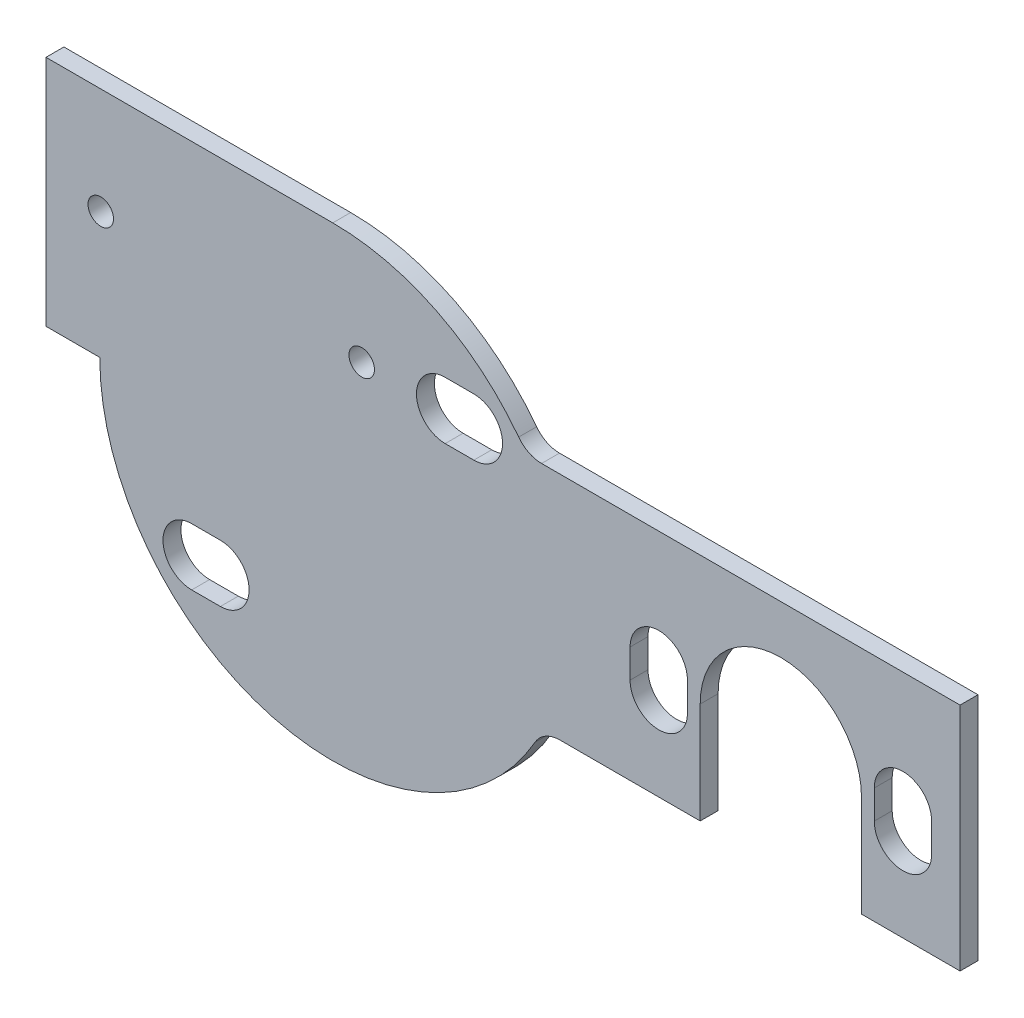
ISO-10303-21;
HEADER;
FILE_DESCRIPTION(('STEP AP214'),'2;1');
FILE_NAME('part.step','',(''),(''),'','','');
FILE_SCHEMA(('AUTOMOTIVE_DESIGN { 1 0 10303 214 1 1 1 1 }'));
ENDSEC;
DATA;
#1=APPLICATION_CONTEXT('core data for automotive mechanical design processes');
#2=APPLICATION_PROTOCOL_DEFINITION('international standard','automotive_design',2000,#1);
#3=PRODUCT_CONTEXT('',#1,'mechanical');
#4=PRODUCT('Part','Part','',(#3));
#5=PRODUCT_RELATED_PRODUCT_CATEGORY('part','',(#4));
#6=PRODUCT_DEFINITION_FORMATION('','',#4);
#7=PRODUCT_DEFINITION_CONTEXT('part definition',#1,'design');
#8=PRODUCT_DEFINITION('design','',#6,#7);
#9=PRODUCT_DEFINITION_SHAPE('','',#8);
#10=(LENGTH_UNIT() NAMED_UNIT(*) SI_UNIT(.MILLI.,.METRE.));
#11=(NAMED_UNIT(*) PLANE_ANGLE_UNIT() SI_UNIT($,.RADIAN.));
#12=(NAMED_UNIT(*) SI_UNIT($,.STERADIAN.) SOLID_ANGLE_UNIT());
#13=UNCERTAINTY_MEASURE_WITH_UNIT(LENGTH_MEASURE(1.E-05),#10,'distance_accuracy_value','');
#14=(GEOMETRIC_REPRESENTATION_CONTEXT(3) GLOBAL_UNCERTAINTY_ASSIGNED_CONTEXT((#13)) GLOBAL_UNIT_ASSIGNED_CONTEXT((#10,
#11,#12)) REPRESENTATION_CONTEXT('',''));
#15=CARTESIAN_POINT('',(0.,0.,0.));
#16=DIRECTION('',(0.,0.,1.));
#17=DIRECTION('',(1.,0.,0.));
#18=AXIS2_PLACEMENT_3D('',#15,#16,#17);
#19=CARTESIAN_POINT('',(0.,8.97150910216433,1.58750000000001));
#20=DIRECTION('',(0.,0.,-1.));
#21=DIRECTION('',(-1.,0.,0.));
#22=AXIS2_PLACEMENT_3D('',#19,#20,#21);
#23=CYLINDRICAL_SURFACE('',#22,20.6375);
#24=CARTESIAN_POINT('',(0.,8.97150910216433,0.));
#25=DIRECTION('',(0.,0.,-1.));
#26=DIRECTION('',(-1.,0.,0.));
#27=AXIS2_PLACEMENT_3D('',#24,#25,#26);
#28=CIRCLE('',#27,20.6375);
#29=CARTESIAN_POINT('',(17.9121311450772,-1.27846475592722,0.));
#30=VERTEX_POINT('',#29);
#31=CARTESIAN_POINT('',(-20.6375,8.9715091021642,0.));
#32=VERTEX_POINT('',#31);
#33=EDGE_CURVE('E354',#30,#32,#28,.T.);
#34=ORIENTED_EDGE('',*,*,#33,.F.);
#35=DIRECTION('',(0.,0.,-1.));
#36=VECTOR('',#35,1.);
#37=CARTESIAN_POINT('',(17.9121311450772,-1.27846475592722,1.58750000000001));
#38=LINE('',#37,#36);
#39=CARTESIAN_POINT('',(17.9121311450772,-1.27846475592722,1.58750000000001));
#40=VERTEX_POINT('',#39);
#41=EDGE_CURVE('E11',#40,#30,#38,.T.);
#42=ORIENTED_EDGE('',*,*,#41,.F.);
#43=CARTESIAN_POINT('',(0.,8.97150910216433,1.58750000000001));
#44=DIRECTION('',(0.,0.,-1.));
#45=DIRECTION('',(-1.,0.,0.));
#46=AXIS2_PLACEMENT_3D('',#43,#44,#45);
#47=CIRCLE('',#46,20.6375);
#48=CARTESIAN_POINT('',(-20.6375,8.9715091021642,1.58750000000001));
#49=VERTEX_POINT('',#48);
#50=EDGE_CURVE('E361',#40,#49,#47,.T.);
#51=ORIENTED_EDGE('',*,*,#50,.T.);
#52=DIRECTION('',(0.,0.,-1.));
#53=VECTOR('',#52,1.);
#54=CARTESIAN_POINT('',(-20.6375,8.9715091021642,1.58750000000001));
#55=LINE('',#54,#53);
#56=EDGE_CURVE('E400',#49,#32,#55,.T.);
#57=ORIENTED_EDGE('',*,*,#56,.T.);
#58=EDGE_LOOP('',(#34,#42,#51,#57));
#59=FACE_BOUND('',#58,.T.);
#60=ADVANCED_FACE('F30',(#59),#23,.T.);
#61=CARTESIAN_POINT('',(20.1167011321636,-2.54,1.58750000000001));
#62=DIRECTION('',(0.,0.,-1.));
#63=DIRECTION('',(-1.,0.,0.));
#64=AXIS2_PLACEMENT_3D('',#61,#62,#63);
#65=CYLINDRICAL_SURFACE('',#64,2.54);
#66=CARTESIAN_POINT('',(20.1167011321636,-2.54,0.));
#67=DIRECTION('',(0.,0.,-1.));
#68=DIRECTION('',(-1.,0.,0.));
#69=AXIS2_PLACEMENT_3D('',#66,#67,#68);
#70=CIRCLE('',#69,2.54);
#71=CARTESIAN_POINT('',(20.1167011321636,0.,0.));
#72=VERTEX_POINT('',#71);
#73=EDGE_CURVE('E403',#30,#72,#70,.T.);
#74=ORIENTED_EDGE('',*,*,#73,.T.);
#75=DIRECTION('',(0.,0.,-1.));
#76=VECTOR('',#75,1.);
#77=CARTESIAN_POINT('',(20.1167011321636,0.,1.58750000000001));
#78=LINE('',#77,#76);
#79=CARTESIAN_POINT('',(20.1167011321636,0.,1.58750000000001));
#80=VERTEX_POINT('',#79);
#81=EDGE_CURVE('E37',#80,#72,#78,.T.);
#82=ORIENTED_EDGE('',*,*,#81,.F.);
#83=CARTESIAN_POINT('',(20.1167011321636,-2.54,1.58750000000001));
#84=DIRECTION('',(0.,0.,-1.));
#85=DIRECTION('',(-1.,0.,0.));
#86=AXIS2_PLACEMENT_3D('',#83,#84,#85);
#87=CIRCLE('',#86,2.54);
#88=EDGE_CURVE('E364',#40,#80,#87,.T.);
#89=ORIENTED_EDGE('',*,*,#88,.F.);
#90=ORIENTED_EDGE('',*,*,#41,.T.);
#91=EDGE_LOOP('',(#74,#82,#89,#90));
#92=FACE_BOUND('',#91,.T.);
#93=ADVANCED_FACE('F471',(#92),#65,.F.);
#94=CARTESIAN_POINT('',(-54.1659773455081,1.52655665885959E-13,1.58750000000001));
#95=DIRECTION('',(0.,-1.,0.));
#96=DIRECTION('',(0.,0.,-1.));
#97=AXIS2_PLACEMENT_3D('',#94,#95,#96);
#98=PLANE('',#97);
#99=DIRECTION('',(-1.,0.,0.));
#100=VECTOR('',#99,1.);
#101=CARTESIAN_POINT('',(-54.1659773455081,1.52655665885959E-13,0.));
#102=LINE('',#101,#100);
#103=CARTESIAN_POINT('',(32.5437500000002,0.,0.));
#104=VERTEX_POINT('',#103);
#105=EDGE_CURVE('E406',#104,#72,#102,.T.);
#106=ORIENTED_EDGE('',*,*,#105,.F.);
#107=DIRECTION('',(0.,0.,-1.));
#108=VECTOR('',#107,1.);
#109=CARTESIAN_POINT('',(32.5437500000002,0.,1.58750000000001));
#110=LINE('',#109,#108);
#111=CARTESIAN_POINT('',(32.5437500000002,0.,1.58750000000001));
#112=VERTEX_POINT('',#111);
#113=EDGE_CURVE('E462',#112,#104,#110,.T.);
#114=ORIENTED_EDGE('',*,*,#113,.F.);
#115=DIRECTION('',(-1.,0.,0.));
#116=VECTOR('',#115,1.);
#117=CARTESIAN_POINT('',(-54.1659773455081,1.52655665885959E-13,1.58750000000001));
#118=LINE('',#117,#116);
#119=EDGE_CURVE('E367',#112,#80,#118,.T.);
#120=ORIENTED_EDGE('',*,*,#119,.T.);
#121=ORIENTED_EDGE('',*,*,#81,.T.);
#122=EDGE_LOOP('',(#106,#114,#120,#121));
#123=FACE_BOUND('',#122,.T.);
#124=ADVANCED_FACE('F466',(#123),#98,.T.);
#125=CARTESIAN_POINT('',(32.5437500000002,14.1706045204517,1.58750000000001));
#126=DIRECTION('',(-1.,0.,0.));
#127=DIRECTION('',(0.,0.,1.));
#128=AXIS2_PLACEMENT_3D('',#125,#126,#127);
#129=PLANE('',#128);
#130=DIRECTION('',(0.,1.,0.));
#131=VECTOR('',#130,1.);
#132=CARTESIAN_POINT('',(32.5437500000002,14.1706045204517,0.));
#133=LINE('',#132,#131);
#134=CARTESIAN_POINT('',(32.5437500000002,8.97150910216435,0.));
#135=VERTEX_POINT('',#134);
#136=EDGE_CURVE('E409',#104,#135,#133,.T.);
#137=ORIENTED_EDGE('',*,*,#136,.T.);
#138=DIRECTION('',(0.,0.,-1.));
#139=VECTOR('',#138,1.);
#140=CARTESIAN_POINT('',(32.5437500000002,8.97150910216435,1.58750000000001));
#141=LINE('',#140,#139);
#142=CARTESIAN_POINT('',(32.5437500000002,8.97150910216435,1.58750000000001));
#143=VERTEX_POINT('',#142);
#144=EDGE_CURVE('E459',#143,#135,#141,.T.);
#145=ORIENTED_EDGE('',*,*,#144,.F.);
#146=DIRECTION('',(0.,1.,0.));
#147=VECTOR('',#146,1.);
#148=CARTESIAN_POINT('',(32.5437500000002,14.1706045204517,1.58750000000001));
#149=LINE('',#148,#147);
#150=EDGE_CURVE('E370',#112,#143,#149,.T.);
#151=ORIENTED_EDGE('',*,*,#150,.F.);
#152=ORIENTED_EDGE('',*,*,#113,.T.);
#153=EDGE_LOOP('',(#137,#145,#151,#152));
#154=FACE_BOUND('',#153,.T.);
#155=ADVANCED_FACE('F478',(#154),#129,.F.);
#156=CARTESIAN_POINT('',(39.6875000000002,8.97150910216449,1.58750000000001));
#157=DIRECTION('',(0.,0.,-1.));
#158=DIRECTION('',(-1.,0.,0.));
#159=AXIS2_PLACEMENT_3D('',#156,#157,#158);
#160=CYLINDRICAL_SURFACE('',#159,7.14375);
#161=CARTESIAN_POINT('',(39.6875000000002,8.97150910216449,0.));
#162=DIRECTION('',(0.,0.,-1.));
#163=DIRECTION('',(-1.,0.,0.));
#164=AXIS2_PLACEMENT_3D('',#161,#162,#163);
#165=CIRCLE('',#164,7.14375);
#166=CARTESIAN_POINT('',(46.8312500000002,8.97150910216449,0.));
#167=VERTEX_POINT('',#166);
#168=EDGE_CURVE('E411',#135,#167,#165,.T.);
#169=ORIENTED_EDGE('',*,*,#168,.T.);
#170=DIRECTION('',(0.,0.,-1.));
#171=VECTOR('',#170,1.);
#172=CARTESIAN_POINT('',(46.8312500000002,8.97150910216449,1.58750000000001));
#173=LINE('',#172,#171);
#174=CARTESIAN_POINT('',(46.8312500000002,8.97150910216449,1.58750000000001));
#175=VERTEX_POINT('',#174);
#176=EDGE_CURVE('E457',#175,#167,#173,.T.);
#177=ORIENTED_EDGE('',*,*,#176,.F.);
#178=CARTESIAN_POINT('',(39.6875000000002,8.97150910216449,1.58750000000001));
#179=DIRECTION('',(0.,0.,-1.));
#180=DIRECTION('',(-1.,0.,0.));
#181=AXIS2_PLACEMENT_3D('',#178,#179,#180);
#182=CIRCLE('',#181,7.14375);
#183=EDGE_CURVE('E372',#143,#175,#182,.T.);
#184=ORIENTED_EDGE('',*,*,#183,.F.);
#185=ORIENTED_EDGE('',*,*,#144,.T.);
#186=EDGE_LOOP('',(#169,#177,#184,#185));
#187=FACE_BOUND('',#186,.T.);
#188=ADVANCED_FACE('F482',(#187),#160,.F.);
#189=CARTESIAN_POINT('',(46.8312500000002,14.1706045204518,1.58750000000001));
#190=DIRECTION('',(-1.,0.,0.));
#191=DIRECTION('',(0.,-1.,0.));
#192=AXIS2_PLACEMENT_3D('',#189,#190,#191);
#193=PLANE('',#192);
#194=DIRECTION('',(0.,1.,0.));
#195=VECTOR('',#194,1.);
#196=CARTESIAN_POINT('',(46.8312500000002,14.1706045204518,0.));
#197=LINE('',#196,#195);
#198=CARTESIAN_POINT('',(46.8312500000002,0.,0.));
#199=VERTEX_POINT('',#198);
#200=EDGE_CURVE('E414',#199,#167,#197,.T.);
#201=ORIENTED_EDGE('',*,*,#200,.F.);
#202=DIRECTION('',(0.,0.,-1.));
#203=VECTOR('',#202,1.);
#204=CARTESIAN_POINT('',(46.8312500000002,0.,1.58750000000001));
#205=LINE('',#204,#203);
#206=CARTESIAN_POINT('',(46.8312500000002,0.,1.58750000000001));
#207=VERTEX_POINT('',#206);
#208=EDGE_CURVE('E455',#207,#199,#205,.T.);
#209=ORIENTED_EDGE('',*,*,#208,.F.);
#210=DIRECTION('',(0.,1.,0.));
#211=VECTOR('',#210,1.);
#212=CARTESIAN_POINT('',(46.8312500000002,14.1706045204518,1.58750000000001));
#213=LINE('',#212,#211);
#214=EDGE_CURVE('E374',#207,#175,#213,.T.);
#215=ORIENTED_EDGE('',*,*,#214,.T.);
#216=ORIENTED_EDGE('',*,*,#176,.T.);
#217=EDGE_LOOP('',(#201,#209,#215,#216));
#218=FACE_BOUND('',#217,.T.);
#219=ADVANCED_FACE('F523',(#218),#193,.T.);
#220=CARTESIAN_POINT('',(-54.1659773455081,1.11022302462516E-13,1.58750000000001));
#221=DIRECTION('',(0.,-1.,0.));
#222=DIRECTION('',(1.,0.,0.));
#223=AXIS2_PLACEMENT_3D('',#220,#221,#222);
#224=PLANE('',#223);
#225=DIRECTION('',(-1.,0.,0.));
#226=VECTOR('',#225,1.);
#227=CARTESIAN_POINT('',(-54.1659773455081,1.11022302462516E-13,0.));
#228=LINE('',#227,#226);
#229=CARTESIAN_POINT('',(55.5625000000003,0.,0.));
#230=VERTEX_POINT('',#229);
#231=EDGE_CURVE('E417',#230,#199,#228,.T.);
#232=ORIENTED_EDGE('',*,*,#231,.F.);
#233=DIRECTION('',(0.,0.,-1.));
#234=VECTOR('',#233,1.);
#235=CARTESIAN_POINT('',(55.5625000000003,0.,1.58750000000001));
#236=LINE('',#235,#234);
#237=CARTESIAN_POINT('',(55.5625000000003,0.,1.58750000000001));
#238=VERTEX_POINT('',#237);
#239=EDGE_CURVE('E453',#238,#230,#236,.T.);
#240=ORIENTED_EDGE('',*,*,#239,.F.);
#241=DIRECTION('',(-1.,0.,0.));
#242=VECTOR('',#241,1.);
#243=CARTESIAN_POINT('',(-54.1659773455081,1.11022302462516E-13,1.58750000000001));
#244=LINE('',#243,#242);
#245=EDGE_CURVE('E377',#238,#207,#244,.T.);
#246=ORIENTED_EDGE('',*,*,#245,.T.);
#247=ORIENTED_EDGE('',*,*,#208,.T.);
#248=EDGE_LOOP('',(#232,#240,#246,#247));
#249=FACE_BOUND('',#248,.T.);
#250=ADVANCED_FACE('F520',(#249),#224,.T.);
#251=CARTESIAN_POINT('',(55.5625000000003,14.1706045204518,1.58750000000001));
#252=DIRECTION('',(1.,0.,0.));
#253=DIRECTION('',(0.,1.,0.));
#254=AXIS2_PLACEMENT_3D('',#251,#252,#253);
#255=PLANE('',#254);
#256=DIRECTION('',(0.,-1.,0.));
#257=VECTOR('',#256,1.);
#258=CARTESIAN_POINT('',(55.5625000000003,14.1706045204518,0.));
#259=LINE('',#258,#257);
#260=CARTESIAN_POINT('',(55.5625000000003,20.4015091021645,0.));
#261=VERTEX_POINT('',#260);
#262=EDGE_CURVE('E420',#261,#230,#259,.T.);
#263=ORIENTED_EDGE('',*,*,#262,.F.);
#264=DIRECTION('',(0.,0.,-1.));
#265=VECTOR('',#264,1.);
#266=CARTESIAN_POINT('',(55.5625000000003,20.4015091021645,1.58750000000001));
#267=LINE('',#266,#265);
#268=CARTESIAN_POINT('',(55.5625000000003,20.4015091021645,1.58750000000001));
#269=VERTEX_POINT('',#268);
#270=EDGE_CURVE('E451',#269,#261,#267,.T.);
#271=ORIENTED_EDGE('',*,*,#270,.F.);
#272=DIRECTION('',(0.,-1.,0.));
#273=VECTOR('',#272,1.);
#274=CARTESIAN_POINT('',(55.5625000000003,14.1706045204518,1.58750000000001));
#275=LINE('',#274,#273);
#276=EDGE_CURVE('E380',#269,#238,#275,.T.);
#277=ORIENTED_EDGE('',*,*,#276,.T.);
#278=ORIENTED_EDGE('',*,*,#239,.T.);
#279=EDGE_LOOP('',(#263,#271,#277,#278));
#280=FACE_BOUND('',#279,.T.);
#281=ADVANCED_FACE('F515',(#280),#255,.T.);
#282=CARTESIAN_POINT('',(-54.1659773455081,20.4015091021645,1.58750000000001));
#283=DIRECTION('',(0.,-1.,0.));
#284=DIRECTION('',(1.,0.,0.));
#285=AXIS2_PLACEMENT_3D('',#282,#283,#284);
#286=PLANE('',#285);
#287=DIRECTION('',(-1.,0.,0.));
#288=VECTOR('',#287,1.);
#289=CARTESIAN_POINT('',(-54.1659773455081,20.4015091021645,0.));
#290=LINE('',#289,#288);
#291=CARTESIAN_POINT('',(18.4942046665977,20.4015091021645,0.));
#292=VERTEX_POINT('',#291);
#293=EDGE_CURVE('E423',#261,#292,#290,.T.);
#294=ORIENTED_EDGE('',*,*,#293,.T.);
#295=DIRECTION('',(0.,0.,-1.));
#296=VECTOR('',#295,1.);
#297=CARTESIAN_POINT('',(18.4942046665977,20.4015091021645,1.58750000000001));
#298=LINE('',#297,#296);
#299=CARTESIAN_POINT('',(18.4942046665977,20.4015091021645,1.58750000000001));
#300=VERTEX_POINT('',#299);
#301=EDGE_CURVE('E449',#300,#292,#298,.T.);
#302=ORIENTED_EDGE('',*,*,#301,.F.);
#303=DIRECTION('',(-1.,0.,0.));
#304=VECTOR('',#303,1.);
#305=CARTESIAN_POINT('',(-54.1659773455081,20.4015091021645,1.58750000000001));
#306=LINE('',#305,#304);
#307=EDGE_CURVE('E383',#269,#300,#306,.T.);
#308=ORIENTED_EDGE('',*,*,#307,.F.);
#309=ORIENTED_EDGE('',*,*,#270,.T.);
#310=EDGE_LOOP('',(#294,#302,#308,#309));
#311=FACE_BOUND('',#310,.T.);
#312=ADVANCED_FACE('F563',(#311),#286,.F.);
#313=CARTESIAN_POINT('',(18.4942046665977,22.9415091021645,1.58750000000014));
#314=DIRECTION('',(0.,0.,-1.));
#315=DIRECTION('',(-1.,0.,0.));
#316=AXIS2_PLACEMENT_3D('',#313,#314,#315);
#317=CYLINDRICAL_SURFACE('',#316,2.54);
#318=CARTESIAN_POINT('',(18.4942046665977,22.9415091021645,1.52655665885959E-13));
#319=DIRECTION('',(0.,0.,-1.));
#320=DIRECTION('',(-1.,0.,0.));
#321=AXIS2_PLACEMENT_3D('',#318,#319,#320);
#322=CIRCLE('',#321,2.54);
#323=CARTESIAN_POINT('',(16.4674425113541,21.4105501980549,1.52655665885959E-13));
#324=VERTEX_POINT('',#323);
#325=EDGE_CURVE('E426',#324,#292,#322,.F.);
#326=ORIENTED_EDGE('',*,*,#325,.F.);
#327=DIRECTION('',(0.,0.,-1.));
#328=VECTOR('',#327,1.);
#329=CARTESIAN_POINT('',(16.4674425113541,21.4105501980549,1.58750000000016));
#330=LINE('',#329,#328);
#331=CARTESIAN_POINT('',(16.4674425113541,21.4105501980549,1.58750000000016));
#332=VERTEX_POINT('',#331);
#333=EDGE_CURVE('E447',#332,#324,#330,.T.);
#334=ORIENTED_EDGE('',*,*,#333,.F.);
#335=CARTESIAN_POINT('',(18.4942046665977,22.9415091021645,1.58750000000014));
#336=DIRECTION('',(0.,0.,-1.));
#337=DIRECTION('',(-1.,0.,0.));
#338=AXIS2_PLACEMENT_3D('',#335,#336,#337);
#339=CIRCLE('',#338,2.54);
#340=EDGE_CURVE('E385',#332,#300,#339,.F.);
#341=ORIENTED_EDGE('',*,*,#340,.T.);
#342=ORIENTED_EDGE('',*,*,#301,.T.);
#343=EDGE_LOOP('',(#326,#334,#341,#342));
#344=FACE_BOUND('',#343,.T.);
#345=ADVANCED_FACE('F509',(#344),#317,.F.);
#346=CARTESIAN_POINT('',(0.,8.97150910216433,1.58750000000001));
#347=DIRECTION('',(0.,0.,-1.));
#348=DIRECTION('',(-1.,0.,0.));
#349=AXIS2_PLACEMENT_3D('',#346,#347,#348);
#350=CYLINDRICAL_SURFACE('',#349,20.6375);
#351=CARTESIAN_POINT('',(0.,8.97150910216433,0.));
#352=DIRECTION('',(0.,0.,-1.));
#353=DIRECTION('',(-1.,0.,0.));
#354=AXIS2_PLACEMENT_3D('',#351,#352,#353);
#355=CIRCLE('',#354,20.6375);
#356=CARTESIAN_POINT('',(0.,29.6090091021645,1.52655665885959E-13));
#357=VERTEX_POINT('',#356);
#358=EDGE_CURVE('E429',#357,#324,#355,.T.);
#359=ORIENTED_EDGE('',*,*,#358,.F.);
#360=DIRECTION('',(0.,0.,-1.));
#361=VECTOR('',#360,1.);
#362=CARTESIAN_POINT('',(0.,29.6090091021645,1.58750000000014));
#363=LINE('',#362,#361);
#364=CARTESIAN_POINT('',(0.,29.6090091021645,1.58750000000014));
#365=VERTEX_POINT('',#364);
#366=EDGE_CURVE('E445',#365,#357,#363,.T.);
#367=ORIENTED_EDGE('',*,*,#366,.F.);
#368=CARTESIAN_POINT('',(0.,8.97150910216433,1.58750000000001));
#369=DIRECTION('',(0.,0.,-1.));
#370=DIRECTION('',(-1.,0.,0.));
#371=AXIS2_PLACEMENT_3D('',#368,#369,#370);
#372=CIRCLE('',#371,20.6375);
#373=EDGE_CURVE('E388',#365,#332,#372,.T.);
#374=ORIENTED_EDGE('',*,*,#373,.T.);
#375=ORIENTED_EDGE('',*,*,#333,.T.);
#376=EDGE_LOOP('',(#359,#367,#374,#375));
#377=FACE_BOUND('',#376,.T.);
#378=ADVANCED_FACE('F505',(#377),#350,.T.);
#379=CARTESIAN_POINT('',(-54.1659773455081,29.6090091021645,1.58750000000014));
#380=DIRECTION('',(0.,1.,0.));
#381=DIRECTION('',(0.,0.,1.));
#382=AXIS2_PLACEMENT_3D('',#379,#380,#381);
#383=PLANE('',#382);
#384=DIRECTION('',(1.,0.,0.));
#385=VECTOR('',#384,1.);
#386=CARTESIAN_POINT('',(-54.1659773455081,29.6090091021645,1.52655665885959E-13));
#387=LINE('',#386,#385);
#388=CARTESIAN_POINT('',(-25.4000000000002,29.6090091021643,1.52655665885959E-13));
#389=VERTEX_POINT('',#388);
#390=EDGE_CURVE('E432',#389,#357,#387,.T.);
#391=ORIENTED_EDGE('',*,*,#390,.F.);
#392=DIRECTION('',(0.,0.,-1.));
#393=VECTOR('',#392,1.);
#394=CARTESIAN_POINT('',(-25.4000000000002,29.6090091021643,1.58750000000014));
#395=LINE('',#394,#393);
#396=CARTESIAN_POINT('',(-25.4000000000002,29.6090091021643,1.58750000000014));
#397=VERTEX_POINT('',#396);
#398=EDGE_CURVE('E443',#397,#389,#395,.T.);
#399=ORIENTED_EDGE('',*,*,#398,.F.);
#400=DIRECTION('',(1.,0.,0.));
#401=VECTOR('',#400,1.);
#402=CARTESIAN_POINT('',(-54.1659773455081,29.6090091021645,1.58750000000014));
#403=LINE('',#402,#401);
#404=EDGE_CURVE('E391',#397,#365,#403,.T.);
#405=ORIENTED_EDGE('',*,*,#404,.T.);
#406=ORIENTED_EDGE('',*,*,#366,.T.);
#407=EDGE_LOOP('',(#391,#399,#405,#406));
#408=FACE_BOUND('',#407,.T.);
#409=ADVANCED_FACE('F501',(#408),#383,.T.);
#410=CARTESIAN_POINT('',(-25.4000000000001,14.1706045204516,1.58750000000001));
#411=DIRECTION('',(-1.,0.,0.));
#412=DIRECTION('',(0.,-1.,0.));
#413=AXIS2_PLACEMENT_3D('',#410,#411,#412);
#414=PLANE('',#413);
#415=DIRECTION('',(0.,1.,0.));
#416=VECTOR('',#415,1.);
#417=CARTESIAN_POINT('',(-25.4000000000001,14.1706045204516,0.));
#418=LINE('',#417,#416);
#419=CARTESIAN_POINT('',(-25.4000000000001,8.97150910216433,0.));
#420=VERTEX_POINT('',#419);
#421=EDGE_CURVE('E435',#420,#389,#418,.T.);
#422=ORIENTED_EDGE('',*,*,#421,.F.);
#423=DIRECTION('',(0.,0.,-1.));
#424=VECTOR('',#423,1.);
#425=CARTESIAN_POINT('',(-25.4000000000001,8.97150910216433,1.58750000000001));
#426=LINE('',#425,#424);
#427=CARTESIAN_POINT('',(-25.4000000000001,8.97150910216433,1.58750000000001));
#428=VERTEX_POINT('',#427);
#429=EDGE_CURVE('E441',#428,#420,#426,.T.);
#430=ORIENTED_EDGE('',*,*,#429,.F.);
#431=DIRECTION('',(0.,1.,0.));
#432=VECTOR('',#431,1.);
#433=CARTESIAN_POINT('',(-25.4000000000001,14.1706045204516,1.58750000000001));
#434=LINE('',#433,#432);
#435=EDGE_CURVE('E394',#428,#397,#434,.T.);
#436=ORIENTED_EDGE('',*,*,#435,.T.);
#437=ORIENTED_EDGE('',*,*,#398,.T.);
#438=EDGE_LOOP('',(#422,#430,#436,#437));
#439=FACE_BOUND('',#438,.T.);
#440=ADVANCED_FACE('F497',(#439),#414,.T.);
#441=CARTESIAN_POINT('',(-54.1659773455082,8.97150910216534,1.58750000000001));
#442=DIRECTION('',(0.,-1.,0.));
#443=DIRECTION('',(1.,0.,0.));
#444=AXIS2_PLACEMENT_3D('',#441,#442,#443);
#445=PLANE('',#444);
#446=DIRECTION('',(-1.,0.,0.));
#447=VECTOR('',#446,1.);
#448=CARTESIAN_POINT('',(-54.1659773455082,8.97150910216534,0.));
#449=LINE('',#448,#447);
#450=EDGE_CURVE('E365',#32,#420,#449,.T.);
#451=ORIENTED_EDGE('',*,*,#450,.F.);
#452=ORIENTED_EDGE('',*,*,#56,.F.);
#453=DIRECTION('',(-1.,0.,0.));
#454=VECTOR('',#453,1.);
#455=CARTESIAN_POINT('',(-54.1659773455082,8.97150910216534,1.58750000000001));
#456=LINE('',#455,#454);
#457=EDGE_CURVE('E397',#49,#428,#456,.T.);
#458=ORIENTED_EDGE('',*,*,#457,.T.);
#459=ORIENTED_EDGE('',*,*,#429,.T.);
#460=EDGE_LOOP('',(#451,#452,#458,#459));
#461=FACE_BOUND('',#460,.T.);
#462=ADVANCED_FACE('F494',(#461),#445,.T.);
#463=CARTESIAN_POINT('',(-54.1659773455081,14.1706045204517,1.58750000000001));
#464=DIRECTION('',(0.,0.,-1.));
#465=DIRECTION('',(-1.,0.,0.));
#466=AXIS2_PLACEMENT_3D('',#463,#464,#465);
#467=PLANE('',#466);
#468=CARTESIAN_POINT('',(-20.5493398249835,20.1978339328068,1.58750000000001));
#469=DIRECTION('',(0.,0.,1.));
#470=DIRECTION('',(1.,0.,0.));
#471=AXIS2_PLACEMENT_3D('',#468,#469,#470);
#472=CIRCLE('',#471,1.13029999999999);
#473=CARTESIAN_POINT('',(-19.4190398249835,20.1978339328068,1.58750000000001));
#474=VERTEX_POINT('',#473);
#475=EDGE_CURVE('E760',#474,#474,#472,.T.);
#476=ORIENTED_EDGE('',*,*,#475,.F.);
#477=EDGE_LOOP('',(#476));
#478=FACE_BOUND('',#477,.T.);
#479=CARTESIAN_POINT('',(2.56466017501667,20.1978339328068,1.58750000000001));
#480=DIRECTION('',(0.,0.,1.));
#481=DIRECTION('',(1.,0.,0.));
#482=AXIS2_PLACEMENT_3D('',#479,#480,#481);
#483=CIRCLE('',#482,1.13029999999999);
#484=CARTESIAN_POINT('',(3.69496017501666,20.1978339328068,1.58750000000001));
#485=VERTEX_POINT('',#484);
#486=EDGE_CURVE('E762',#485,#485,#483,.T.);
#487=ORIENTED_EDGE('',*,*,#486,.F.);
#488=EDGE_LOOP('',(#487));
#489=FACE_BOUND('',#488,.T.);
#490=DIRECTION('',(-1.,0.,0.));
#491=VECTOR('',#490,1.);
#492=CARTESIAN_POINT('',(12.4953201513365,22.7368292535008,1.58750000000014));
#493=LINE('',#492,#491);
#494=CARTESIAN_POINT('',(12.4953201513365,22.7368292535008,1.58750000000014));
#495=VERTEX_POINT('',#494);
#496=CARTESIAN_POINT('',(9.95532015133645,22.7368292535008,1.58750000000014));
#497=VERTEX_POINT('',#496);
#498=EDGE_CURVE('E255',#495,#497,#493,.T.);
#499=ORIENTED_EDGE('',*,*,#498,.F.);
#500=CARTESIAN_POINT('',(12.4953201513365,20.1968292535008,1.58750000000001));
#501=DIRECTION('',(0.,0.,1.));
#502=DIRECTION('',(1.,0.,0.));
#503=AXIS2_PLACEMENT_3D('',#500,#501,#502);
#504=CIRCLE('',#503,2.54);
#505=CARTESIAN_POINT('',(12.4953201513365,17.6568292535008,1.58750000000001));
#506=VERTEX_POINT('',#505);
#507=EDGE_CURVE('E44',#506,#495,#504,.T.);
#508=ORIENTED_EDGE('',*,*,#507,.F.);
#509=DIRECTION('',(1.,0.,0.));
#510=VECTOR('',#509,1.);
#511=CARTESIAN_POINT('',(12.4953201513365,17.6568292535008,1.58750000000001));
#512=LINE('',#511,#510);
#513=CARTESIAN_POINT('',(9.95532015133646,17.6568292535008,1.58750000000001));
#514=VERTEX_POINT('',#513);
#515=EDGE_CURVE('E243',#514,#506,#512,.T.);
#516=ORIENTED_EDGE('',*,*,#515,.F.);
#517=CARTESIAN_POINT('',(9.95532015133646,20.1968292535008,1.58750000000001));
#518=DIRECTION('',(0.,0.,1.));
#519=DIRECTION('',(1.,0.,0.));
#520=AXIS2_PLACEMENT_3D('',#517,#518,#519);
#521=CIRCLE('',#520,2.54);
#522=EDGE_CURVE('E246',#497,#514,#521,.T.);
#523=ORIENTED_EDGE('',*,*,#522,.F.);
#524=EDGE_LOOP('',(#499,#508,#516,#523));
#525=FACE_BOUND('',#524,.T.);
#526=DIRECTION('',(-1.,0.,0.));
#527=VECTOR('',#526,1.);
#528=CARTESIAN_POINT('',(-9.95532015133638,0.286188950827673,1.58750000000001));
#529=LINE('',#528,#527);
#530=CARTESIAN_POINT('',(-9.95532015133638,0.286188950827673,1.58750000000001));
#531=VERTEX_POINT('',#530);
#532=CARTESIAN_POINT('',(-12.4953201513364,0.286188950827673,1.58750000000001));
#533=VERTEX_POINT('',#532);
#534=EDGE_CURVE('E280',#531,#533,#529,.T.);
#535=ORIENTED_EDGE('',*,*,#534,.F.);
#536=CARTESIAN_POINT('',(-9.95532015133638,-2.25381104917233,1.58750000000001));
#537=DIRECTION('',(0.,0.,1.));
#538=DIRECTION('',(1.,0.,0.));
#539=AXIS2_PLACEMENT_3D('',#536,#537,#538);
#540=CIRCLE('',#539,2.54);
#541=CARTESIAN_POINT('',(-9.9553201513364,-4.79381104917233,1.58750000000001));
#542=VERTEX_POINT('',#541);
#543=EDGE_CURVE('E261',#542,#531,#540,.T.);
#544=ORIENTED_EDGE('',*,*,#543,.F.);
#545=DIRECTION('',(1.,0.,0.));
#546=VECTOR('',#545,1.);
#547=CARTESIAN_POINT('',(-9.9553201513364,-4.79381104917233,1.58750000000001));
#548=LINE('',#547,#546);
#549=CARTESIAN_POINT('',(-12.4953201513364,-4.79381104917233,1.58750000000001));
#550=VERTEX_POINT('',#549);
#551=EDGE_CURVE('E269',#550,#542,#548,.T.);
#552=ORIENTED_EDGE('',*,*,#551,.F.);
#553=CARTESIAN_POINT('',(-12.4953201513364,-2.25381104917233,1.58750000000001));
#554=DIRECTION('',(0.,0.,1.));
#555=DIRECTION('',(1.,0.,0.));
#556=AXIS2_PLACEMENT_3D('',#553,#554,#555);
#557=CIRCLE('',#556,2.54);
#558=EDGE_CURVE('E283',#533,#550,#557,.T.);
#559=ORIENTED_EDGE('',*,*,#558,.F.);
#560=EDGE_LOOP('',(#535,#544,#552,#559));
#561=FACE_BOUND('',#560,.T.);
#562=DIRECTION('',(0.,1.,0.));
#563=VECTOR('',#562,1.);
#564=CARTESIAN_POINT('',(53.0415500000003,7.70150910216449,1.58750000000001));
#565=LINE('',#564,#563);
#566=CARTESIAN_POINT('',(53.0415500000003,7.70150910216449,1.58750000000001));
#567=VERTEX_POINT('',#566);
#568=CARTESIAN_POINT('',(53.0415500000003,10.2415091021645,1.58750000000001));
#569=VERTEX_POINT('',#568);
#570=EDGE_CURVE('E312',#567,#569,#565,.T.);
#571=ORIENTED_EDGE('',*,*,#570,.F.);
#572=CARTESIAN_POINT('',(50.5015500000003,7.70150910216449,1.58750000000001));
#573=DIRECTION('',(0.,0.,1.));
#574=DIRECTION('',(1.,0.,0.));
#575=AXIS2_PLACEMENT_3D('',#572,#573,#574);
#576=CIRCLE('',#575,2.54);
#577=CARTESIAN_POINT('',(47.9615500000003,7.70150910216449,1.58750000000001));
#578=VERTEX_POINT('',#577);
#579=EDGE_CURVE('E290',#578,#567,#576,.T.);
#580=ORIENTED_EDGE('',*,*,#579,.F.);
#581=DIRECTION('',(0.,-1.,0.));
#582=VECTOR('',#581,1.);
#583=CARTESIAN_POINT('',(47.9615500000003,7.70150910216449,1.58750000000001));
#584=LINE('',#583,#582);
#585=CARTESIAN_POINT('',(47.9615500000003,10.2415091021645,1.58750000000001));
#586=VERTEX_POINT('',#585);
#587=EDGE_CURVE('E301',#586,#578,#584,.T.);
#588=ORIENTED_EDGE('',*,*,#587,.F.);
#589=CARTESIAN_POINT('',(50.5015500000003,10.2415091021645,1.58750000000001));
#590=DIRECTION('',(0.,0.,1.));
#591=DIRECTION('',(1.,0.,0.));
#592=AXIS2_PLACEMENT_3D('',#589,#590,#591);
#593=CIRCLE('',#592,2.54);
#594=EDGE_CURVE('E315',#569,#586,#593,.T.);
#595=ORIENTED_EDGE('',*,*,#594,.F.);
#596=EDGE_LOOP('',(#571,#580,#588,#595));
#597=FACE_BOUND('',#596,.T.);
#598=DIRECTION('',(0.,-1.,0.));
#599=VECTOR('',#598,1.);
#600=CARTESIAN_POINT('',(26.3334500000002,10.2415091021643,1.58750000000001));
#601=LINE('',#600,#599);
#602=CARTESIAN_POINT('',(26.3334500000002,10.2415091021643,1.58750000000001));
#603=VERTEX_POINT('',#602);
#604=CARTESIAN_POINT('',(26.3334500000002,7.70150910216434,1.58750000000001));
#605=VERTEX_POINT('',#604);
#606=EDGE_CURVE('E344',#603,#605,#601,.T.);
#607=ORIENTED_EDGE('',*,*,#606,.F.);
#608=CARTESIAN_POINT('',(28.8734500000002,10.2415091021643,1.58750000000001));
#609=DIRECTION('',(0.,0.,1.));
#610=DIRECTION('',(1.,0.,0.));
#611=AXIS2_PLACEMENT_3D('',#608,#609,#610);
#612=CIRCLE('',#611,2.54);
#613=CARTESIAN_POINT('',(31.4134500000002,10.2415091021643,1.58750000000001));
#614=VERTEX_POINT('',#613);
#615=EDGE_CURVE('E322',#614,#603,#612,.T.);
#616=ORIENTED_EDGE('',*,*,#615,.F.);
#617=DIRECTION('',(0.,1.,0.));
#618=VECTOR('',#617,1.);
#619=CARTESIAN_POINT('',(31.4134500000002,7.70150910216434,1.58750000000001));
#620=LINE('',#619,#618);
#621=CARTESIAN_POINT('',(31.4134500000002,7.70150910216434,1.58750000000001));
#622=VERTEX_POINT('',#621);
#623=EDGE_CURVE('E333',#622,#614,#620,.T.);
#624=ORIENTED_EDGE('',*,*,#623,.F.);
#625=CARTESIAN_POINT('',(28.8734500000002,7.70150910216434,1.58750000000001));
#626=DIRECTION('',(0.,0.,1.));
#627=DIRECTION('',(1.,0.,0.));
#628=AXIS2_PLACEMENT_3D('',#625,#626,#627);
#629=CIRCLE('',#628,2.54);
#630=EDGE_CURVE('E347',#605,#622,#629,.T.);
#631=ORIENTED_EDGE('',*,*,#630,.F.);
#632=EDGE_LOOP('',(#607,#616,#624,#631));
#633=FACE_BOUND('',#632,.T.);
#634=ORIENTED_EDGE('',*,*,#50,.F.);
#635=ORIENTED_EDGE('',*,*,#88,.T.);
#636=ORIENTED_EDGE('',*,*,#119,.F.);
#637=ORIENTED_EDGE('',*,*,#150,.T.);
#638=ORIENTED_EDGE('',*,*,#183,.T.);
#639=ORIENTED_EDGE('',*,*,#214,.F.);
#640=ORIENTED_EDGE('',*,*,#245,.F.);
#641=ORIENTED_EDGE('',*,*,#276,.F.);
#642=ORIENTED_EDGE('',*,*,#307,.T.);
#643=ORIENTED_EDGE('',*,*,#340,.F.);
#644=ORIENTED_EDGE('',*,*,#373,.F.);
#645=ORIENTED_EDGE('',*,*,#404,.F.);
#646=ORIENTED_EDGE('',*,*,#435,.F.);
#647=ORIENTED_EDGE('',*,*,#457,.F.);
#648=EDGE_LOOP('',(#634,#635,#636,#637,#638,#639,#640,#641,#642,#643,#644,#645,#646,#647));
#649=FACE_BOUND('',#648,.T.);
#650=ADVANCED_FACE('F487',(#478,#489,#525,#561,#597,#633,#649),#467,.F.);
#651=CARTESIAN_POINT('',(-54.1659773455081,14.1706045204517,0.));
#652=DIRECTION('',(0.,0.,-1.));
#653=DIRECTION('',(-1.,0.,0.));
#654=AXIS2_PLACEMENT_3D('',#651,#652,#653);
#655=PLANE('',#654);
#656=CARTESIAN_POINT('',(-20.5493398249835,20.1978339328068,0.));
#657=DIRECTION('',(0.,0.,1.));
#658=DIRECTION('',(1.,0.,0.));
#659=AXIS2_PLACEMENT_3D('',#656,#657,#658);
#660=CIRCLE('',#659,1.1303);
#661=CARTESIAN_POINT('',(-19.4190398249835,20.1978339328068,0.));
#662=VERTEX_POINT('',#661);
#663=EDGE_CURVE('E757',#662,#662,#660,.T.);
#664=ORIENTED_EDGE('',*,*,#663,.T.);
#665=EDGE_LOOP('',(#664));
#666=FACE_BOUND('',#665,.T.);
#667=CARTESIAN_POINT('',(2.56466017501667,20.1978339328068,0.));
#668=DIRECTION('',(0.,0.,1.));
#669=DIRECTION('',(1.,0.,0.));
#670=AXIS2_PLACEMENT_3D('',#667,#668,#669);
#671=CIRCLE('',#670,1.1303);
#672=CARTESIAN_POINT('',(3.69496017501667,20.1978339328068,0.));
#673=VERTEX_POINT('',#672);
#674=EDGE_CURVE('E249',#673,#673,#671,.T.);
#675=ORIENTED_EDGE('',*,*,#674,.T.);
#676=EDGE_LOOP('',(#675));
#677=FACE_BOUND('',#676,.T.);
#678=CARTESIAN_POINT('',(12.4953201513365,20.1968292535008,0.));
#679=DIRECTION('',(0.,0.,1.));
#680=DIRECTION('',(1.,0.,0.));
#681=AXIS2_PLACEMENT_3D('',#678,#679,#680);
#682=CIRCLE('',#681,2.54);
#683=CARTESIAN_POINT('',(12.4953201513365,17.6568292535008,0.));
#684=VERTEX_POINT('',#683);
#685=CARTESIAN_POINT('',(12.4953201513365,22.7368292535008,1.52655665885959E-13));
#686=VERTEX_POINT('',#685);
#687=EDGE_CURVE('E227',#684,#686,#682,.T.);
#688=ORIENTED_EDGE('',*,*,#687,.T.);
#689=DIRECTION('',(-1.,0.,0.));
#690=VECTOR('',#689,1.);
#691=CARTESIAN_POINT('',(12.4953201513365,22.7368292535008,1.52655665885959E-13));
#692=LINE('',#691,#690);
#693=CARTESIAN_POINT('',(9.95532015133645,22.7368292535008,1.52655665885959E-13));
#694=VERTEX_POINT('',#693);
#695=EDGE_CURVE('E236',#686,#694,#692,.T.);
#696=ORIENTED_EDGE('',*,*,#695,.T.);
#697=CARTESIAN_POINT('',(9.95532015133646,20.1968292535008,0.));
#698=DIRECTION('',(0.,0.,1.));
#699=DIRECTION('',(1.,0.,0.));
#700=AXIS2_PLACEMENT_3D('',#697,#698,#699);
#701=CIRCLE('',#700,2.54);
#702=CARTESIAN_POINT('',(9.95532015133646,17.6568292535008,0.));
#703=VERTEX_POINT('',#702);
#704=EDGE_CURVE('E52',#694,#703,#701,.T.);
#705=ORIENTED_EDGE('',*,*,#704,.T.);
#706=DIRECTION('',(1.,0.,0.));
#707=VECTOR('',#706,1.);
#708=CARTESIAN_POINT('',(12.4953201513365,17.6568292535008,0.));
#709=LINE('',#708,#707);
#710=EDGE_CURVE('E233',#703,#684,#709,.T.);
#711=ORIENTED_EDGE('',*,*,#710,.T.);
#712=EDGE_LOOP('',(#688,#696,#705,#711));
#713=FACE_BOUND('',#712,.T.);
#714=CARTESIAN_POINT('',(-9.95532015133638,-2.25381104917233,0.));
#715=DIRECTION('',(0.,0.,1.));
#716=DIRECTION('',(1.,0.,0.));
#717=AXIS2_PLACEMENT_3D('',#714,#715,#716);
#718=CIRCLE('',#717,2.54);
#719=CARTESIAN_POINT('',(-9.9553201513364,-4.79381104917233,0.));
#720=VERTEX_POINT('',#719);
#721=CARTESIAN_POINT('',(-9.95532015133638,0.286188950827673,0.));
#722=VERTEX_POINT('',#721);
#723=EDGE_CURVE('E265',#720,#722,#718,.T.);
#724=ORIENTED_EDGE('',*,*,#723,.T.);
#725=DIRECTION('',(-1.,0.,0.));
#726=VECTOR('',#725,1.);
#727=CARTESIAN_POINT('',(-9.95532015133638,0.286188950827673,0.));
#728=LINE('',#727,#726);
#729=CARTESIAN_POINT('',(-12.4953201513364,0.286188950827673,0.));
#730=VERTEX_POINT('',#729);
#731=EDGE_CURVE('E268',#722,#730,#728,.T.);
#732=ORIENTED_EDGE('',*,*,#731,.T.);
#733=CARTESIAN_POINT('',(-12.4953201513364,-2.25381104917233,0.));
#734=DIRECTION('',(0.,0.,1.));
#735=DIRECTION('',(1.,0.,0.));
#736=AXIS2_PLACEMENT_3D('',#733,#734,#735);
#737=CIRCLE('',#736,2.54);
#738=CARTESIAN_POINT('',(-12.4953201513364,-4.79381104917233,0.));
#739=VERTEX_POINT('',#738);
#740=EDGE_CURVE('E272',#730,#739,#737,.T.);
#741=ORIENTED_EDGE('',*,*,#740,.T.);
#742=DIRECTION('',(1.,0.,0.));
#743=VECTOR('',#742,1.);
#744=CARTESIAN_POINT('',(-9.9553201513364,-4.79381104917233,0.));
#745=LINE('',#744,#743);
#746=EDGE_CURVE('E275',#739,#720,#745,.T.);
#747=ORIENTED_EDGE('',*,*,#746,.T.);
#748=EDGE_LOOP('',(#724,#732,#741,#747));
#749=FACE_BOUND('',#748,.T.);
#750=CARTESIAN_POINT('',(50.5015500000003,7.70150910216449,0.));
#751=DIRECTION('',(0.,0.,1.));
#752=DIRECTION('',(1.,0.,0.));
#753=AXIS2_PLACEMENT_3D('',#750,#751,#752);
#754=CIRCLE('',#753,2.54);
#755=CARTESIAN_POINT('',(47.9615500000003,7.70150910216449,0.));
#756=VERTEX_POINT('',#755);
#757=CARTESIAN_POINT('',(53.0415500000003,7.70150910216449,0.));
#758=VERTEX_POINT('',#757);
#759=EDGE_CURVE('E297',#756,#758,#754,.T.);
#760=ORIENTED_EDGE('',*,*,#759,.T.);
#761=DIRECTION('',(0.,1.,0.));
#762=VECTOR('',#761,1.);
#763=CARTESIAN_POINT('',(53.0415500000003,7.70150910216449,0.));
#764=LINE('',#763,#762);
#765=CARTESIAN_POINT('',(53.0415500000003,10.2415091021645,0.));
#766=VERTEX_POINT('',#765);
#767=EDGE_CURVE('E300',#758,#766,#764,.T.);
#768=ORIENTED_EDGE('',*,*,#767,.T.);
#769=CARTESIAN_POINT('',(50.5015500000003,10.2415091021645,0.));
#770=DIRECTION('',(0.,0.,1.));
#771=DIRECTION('',(1.,0.,0.));
#772=AXIS2_PLACEMENT_3D('',#769,#770,#771);
#773=CIRCLE('',#772,2.54);
#774=CARTESIAN_POINT('',(47.9615500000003,10.2415091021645,0.));
#775=VERTEX_POINT('',#774);
#776=EDGE_CURVE('E304',#766,#775,#773,.T.);
#777=ORIENTED_EDGE('',*,*,#776,.T.);
#778=DIRECTION('',(0.,-1.,0.));
#779=VECTOR('',#778,1.);
#780=CARTESIAN_POINT('',(47.9615500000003,7.70150910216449,0.));
#781=LINE('',#780,#779);
#782=EDGE_CURVE('E307',#775,#756,#781,.T.);
#783=ORIENTED_EDGE('',*,*,#782,.T.);
#784=EDGE_LOOP('',(#760,#768,#777,#783));
#785=FACE_BOUND('',#784,.T.);
#786=CARTESIAN_POINT('',(28.8734500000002,10.2415091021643,0.));
#787=DIRECTION('',(0.,0.,1.));
#788=DIRECTION('',(1.,0.,0.));
#789=AXIS2_PLACEMENT_3D('',#786,#787,#788);
#790=CIRCLE('',#789,2.54);
#791=CARTESIAN_POINT('',(31.4134500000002,10.2415091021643,0.));
#792=VERTEX_POINT('',#791);
#793=CARTESIAN_POINT('',(26.3334500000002,10.2415091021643,0.));
#794=VERTEX_POINT('',#793);
#795=EDGE_CURVE('E329',#792,#794,#790,.T.);
#796=ORIENTED_EDGE('',*,*,#795,.T.);
#797=DIRECTION('',(0.,-1.,0.));
#798=VECTOR('',#797,1.);
#799=CARTESIAN_POINT('',(26.3334500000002,10.2415091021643,0.));
#800=LINE('',#799,#798);
#801=CARTESIAN_POINT('',(26.3334500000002,7.70150910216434,0.));
#802=VERTEX_POINT('',#801);
#803=EDGE_CURVE('E332',#794,#802,#800,.T.);
#804=ORIENTED_EDGE('',*,*,#803,.T.);
#805=CARTESIAN_POINT('',(28.8734500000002,7.70150910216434,0.));
#806=DIRECTION('',(0.,0.,1.));
#807=DIRECTION('',(1.,0.,0.));
#808=AXIS2_PLACEMENT_3D('',#805,#806,#807);
#809=CIRCLE('',#808,2.54);
#810=CARTESIAN_POINT('',(31.4134500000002,7.70150910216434,0.));
#811=VERTEX_POINT('',#810);
#812=EDGE_CURVE('E336',#802,#811,#809,.T.);
#813=ORIENTED_EDGE('',*,*,#812,.T.);
#814=DIRECTION('',(0.,1.,0.));
#815=VECTOR('',#814,1.);
#816=CARTESIAN_POINT('',(31.4134500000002,7.70150910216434,0.));
#817=LINE('',#816,#815);
#818=EDGE_CURVE('E339',#811,#792,#817,.T.);
#819=ORIENTED_EDGE('',*,*,#818,.T.);
#820=EDGE_LOOP('',(#796,#804,#813,#819));
#821=FACE_BOUND('',#820,.T.);
#822=ORIENTED_EDGE('',*,*,#33,.T.);
#823=ORIENTED_EDGE('',*,*,#450,.T.);
#824=ORIENTED_EDGE('',*,*,#421,.T.);
#825=ORIENTED_EDGE('',*,*,#390,.T.);
#826=ORIENTED_EDGE('',*,*,#358,.T.);
#827=ORIENTED_EDGE('',*,*,#325,.T.);
#828=ORIENTED_EDGE('',*,*,#293,.F.);
#829=ORIENTED_EDGE('',*,*,#262,.T.);
#830=ORIENTED_EDGE('',*,*,#231,.T.);
#831=ORIENTED_EDGE('',*,*,#200,.T.);
#832=ORIENTED_EDGE('',*,*,#168,.F.);
#833=ORIENTED_EDGE('',*,*,#136,.F.);
#834=ORIENTED_EDGE('',*,*,#105,.T.);
#835=ORIENTED_EDGE('',*,*,#73,.F.);
#836=EDGE_LOOP('',(#822,#823,#824,#825,#826,#827,#828,#829,#830,#831,#832,#833,#834,#835));
#837=FACE_BOUND('',#836,.T.);
#838=ADVANCED_FACE('F240',(#666,#677,#713,#749,#785,#821,#837),#655,.T.);
#839=CARTESIAN_POINT('',(28.8734500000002,10.2415091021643,0.));
#840=DIRECTION('',(0.,0.,1.));
#841=DIRECTION('',(1.,0.,0.));
#842=AXIS2_PLACEMENT_3D('',#839,#840,#841);
#843=CYLINDRICAL_SURFACE('',#842,2.54);
#844=ORIENTED_EDGE('',*,*,#615,.T.);
#845=DIRECTION('',(0.,0.,1.));
#846=VECTOR('',#845,1.);
#847=CARTESIAN_POINT('',(26.3334500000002,10.2415091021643,0.));
#848=LINE('',#847,#846);
#849=EDGE_CURVE('E342',#794,#603,#848,.T.);
#850=ORIENTED_EDGE('',*,*,#849,.F.);
#851=ORIENTED_EDGE('',*,*,#795,.F.);
#852=DIRECTION('',(0.,0.,1.));
#853=VECTOR('',#852,1.);
#854=CARTESIAN_POINT('',(31.4134500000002,10.2415091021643,0.));
#855=LINE('',#854,#853);
#856=EDGE_CURVE('E352',#792,#614,#855,.T.);
#857=ORIENTED_EDGE('',*,*,#856,.T.);
#858=EDGE_LOOP('',(#844,#850,#851,#857));
#859=FACE_BOUND('',#858,.T.);
#860=ADVANCED_FACE('F613',(#859),#843,.F.);
#861=CARTESIAN_POINT('',(31.4134500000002,7.70150910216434,0.));
#862=DIRECTION('',(1.,0.,0.));
#863=DIRECTION('',(0.,0.,-1.));
#864=AXIS2_PLACEMENT_3D('',#861,#862,#863);
#865=PLANE('',#864);
#866=ORIENTED_EDGE('',*,*,#623,.T.);
#867=ORIENTED_EDGE('',*,*,#856,.F.);
#868=ORIENTED_EDGE('',*,*,#818,.F.);
#869=DIRECTION('',(0.,0.,1.));
#870=VECTOR('',#869,1.);
#871=CARTESIAN_POINT('',(31.4134500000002,7.70150910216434,0.));
#872=LINE('',#871,#870);
#873=EDGE_CURVE('E355',#811,#622,#872,.T.);
#874=ORIENTED_EDGE('',*,*,#873,.T.);
#875=EDGE_LOOP('',(#866,#867,#868,#874));
#876=FACE_BOUND('',#875,.T.);
#877=ADVANCED_FACE('F621',(#876),#865,.F.);
#878=CARTESIAN_POINT('',(28.8734500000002,7.70150910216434,0.));
#879=DIRECTION('',(0.,0.,1.));
#880=DIRECTION('',(1.,0.,0.));
#881=AXIS2_PLACEMENT_3D('',#878,#879,#880);
#882=CYLINDRICAL_SURFACE('',#881,2.54);
#883=ORIENTED_EDGE('',*,*,#630,.T.);
#884=ORIENTED_EDGE('',*,*,#873,.F.);
#885=ORIENTED_EDGE('',*,*,#812,.F.);
#886=DIRECTION('',(0.,0.,1.));
#887=VECTOR('',#886,1.);
#888=CARTESIAN_POINT('',(26.3334500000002,7.70150910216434,0.));
#889=LINE('',#888,#887);
#890=EDGE_CURVE('E357',#802,#605,#889,.T.);
#891=ORIENTED_EDGE('',*,*,#890,.T.);
#892=EDGE_LOOP('',(#883,#884,#885,#891));
#893=FACE_BOUND('',#892,.T.);
#894=ADVANCED_FACE('F629',(#893),#882,.F.);
#895=CARTESIAN_POINT('',(26.3334500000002,10.2415091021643,0.));
#896=DIRECTION('',(-1.,0.,0.));
#897=DIRECTION('',(0.,0.,1.));
#898=AXIS2_PLACEMENT_3D('',#895,#896,#897);
#899=PLANE('',#898);
#900=ORIENTED_EDGE('',*,*,#606,.T.);
#901=ORIENTED_EDGE('',*,*,#890,.F.);
#902=ORIENTED_EDGE('',*,*,#803,.F.);
#903=ORIENTED_EDGE('',*,*,#849,.T.);
#904=EDGE_LOOP('',(#900,#901,#902,#903));
#905=FACE_BOUND('',#904,.T.);
#906=ADVANCED_FACE('F637',(#905),#899,.F.);
#907=CARTESIAN_POINT('',(50.5015500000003,7.70150910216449,0.));
#908=DIRECTION('',(0.,0.,1.));
#909=DIRECTION('',(1.,0.,0.));
#910=AXIS2_PLACEMENT_3D('',#907,#908,#909);
#911=CYLINDRICAL_SURFACE('',#910,2.54);
#912=ORIENTED_EDGE('',*,*,#579,.T.);
#913=DIRECTION('',(0.,0.,1.));
#914=VECTOR('',#913,1.);
#915=CARTESIAN_POINT('',(53.0415500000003,7.70150910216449,0.));
#916=LINE('',#915,#914);
#917=EDGE_CURVE('E310',#758,#567,#916,.T.);
#918=ORIENTED_EDGE('',*,*,#917,.F.);
#919=ORIENTED_EDGE('',*,*,#759,.F.);
#920=DIRECTION('',(0.,0.,1.));
#921=VECTOR('',#920,1.);
#922=CARTESIAN_POINT('',(47.9615500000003,7.70150910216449,0.));
#923=LINE('',#922,#921);
#924=EDGE_CURVE('E320',#756,#578,#923,.T.);
#925=ORIENTED_EDGE('',*,*,#924,.T.);
#926=EDGE_LOOP('',(#912,#918,#919,#925));
#927=FACE_BOUND('',#926,.T.);
#928=ADVANCED_FACE('F645',(#927),#911,.F.);
#929=CARTESIAN_POINT('',(47.9615500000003,7.70150910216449,0.));
#930=DIRECTION('',(-1.,0.,0.));
#931=DIRECTION('',(0.,0.,1.));
#932=AXIS2_PLACEMENT_3D('',#929,#930,#931);
#933=PLANE('',#932);
#934=ORIENTED_EDGE('',*,*,#587,.T.);
#935=ORIENTED_EDGE('',*,*,#924,.F.);
#936=ORIENTED_EDGE('',*,*,#782,.F.);
#937=DIRECTION('',(0.,0.,1.));
#938=VECTOR('',#937,1.);
#939=CARTESIAN_POINT('',(47.9615500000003,10.2415091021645,0.));
#940=LINE('',#939,#938);
#941=EDGE_CURVE('E323',#775,#586,#940,.T.);
#942=ORIENTED_EDGE('',*,*,#941,.T.);
#943=EDGE_LOOP('',(#934,#935,#936,#942));
#944=FACE_BOUND('',#943,.T.);
#945=ADVANCED_FACE('F653',(#944),#933,.F.);
#946=CARTESIAN_POINT('',(50.5015500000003,10.2415091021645,0.));
#947=DIRECTION('',(0.,0.,1.));
#948=DIRECTION('',(1.,0.,0.));
#949=AXIS2_PLACEMENT_3D('',#946,#947,#948);
#950=CYLINDRICAL_SURFACE('',#949,2.54);
#951=ORIENTED_EDGE('',*,*,#594,.T.);
#952=ORIENTED_EDGE('',*,*,#941,.F.);
#953=ORIENTED_EDGE('',*,*,#776,.F.);
#954=DIRECTION('',(0.,0.,1.));
#955=VECTOR('',#954,1.);
#956=CARTESIAN_POINT('',(53.0415500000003,10.2415091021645,0.));
#957=LINE('',#956,#955);
#958=EDGE_CURVE('E325',#766,#569,#957,.T.);
#959=ORIENTED_EDGE('',*,*,#958,.T.);
#960=EDGE_LOOP('',(#951,#952,#953,#959));
#961=FACE_BOUND('',#960,.T.);
#962=ADVANCED_FACE('F661',(#961),#950,.F.);
#963=CARTESIAN_POINT('',(53.0415500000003,7.70150910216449,0.));
#964=DIRECTION('',(1.,0.,0.));
#965=DIRECTION('',(0.,0.,-1.));
#966=AXIS2_PLACEMENT_3D('',#963,#964,#965);
#967=PLANE('',#966);
#968=ORIENTED_EDGE('',*,*,#570,.T.);
#969=ORIENTED_EDGE('',*,*,#958,.F.);
#970=ORIENTED_EDGE('',*,*,#767,.F.);
#971=ORIENTED_EDGE('',*,*,#917,.T.);
#972=EDGE_LOOP('',(#968,#969,#970,#971));
#973=FACE_BOUND('',#972,.T.);
#974=ADVANCED_FACE('F669',(#973),#967,.F.);
#975=CARTESIAN_POINT('',(-9.95532015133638,-2.25381104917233,0.));
#976=DIRECTION('',(0.,0.,1.));
#977=DIRECTION('',(1.,0.,0.));
#978=AXIS2_PLACEMENT_3D('',#975,#976,#977);
#979=CYLINDRICAL_SURFACE('',#978,2.54);
#980=ORIENTED_EDGE('',*,*,#543,.T.);
#981=DIRECTION('',(0.,0.,1.));
#982=VECTOR('',#981,1.);
#983=CARTESIAN_POINT('',(-9.95532015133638,0.286188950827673,0.));
#984=LINE('',#983,#982);
#985=EDGE_CURVE('E278',#722,#531,#984,.T.);
#986=ORIENTED_EDGE('',*,*,#985,.F.);
#987=ORIENTED_EDGE('',*,*,#723,.F.);
#988=DIRECTION('',(0.,0.,1.));
#989=VECTOR('',#988,1.);
#990=CARTESIAN_POINT('',(-9.9553201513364,-4.79381104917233,0.));
#991=LINE('',#990,#989);
#992=EDGE_CURVE('E288',#720,#542,#991,.T.);
#993=ORIENTED_EDGE('',*,*,#992,.T.);
#994=EDGE_LOOP('',(#980,#986,#987,#993));
#995=FACE_BOUND('',#994,.T.);
#996=ADVANCED_FACE('F677',(#995),#979,.F.);
#997=CARTESIAN_POINT('',(-9.9553201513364,-4.79381104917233,0.));
#998=DIRECTION('',(0.,-1.,0.));
#999=DIRECTION('',(1.,0.,0.));
#1000=AXIS2_PLACEMENT_3D('',#997,#998,#999);
#1001=PLANE('',#1000);
#1002=ORIENTED_EDGE('',*,*,#551,.T.);
#1003=ORIENTED_EDGE('',*,*,#992,.F.);
#1004=ORIENTED_EDGE('',*,*,#746,.F.);
#1005=DIRECTION('',(0.,0.,1.));
#1006=VECTOR('',#1005,1.);
#1007=CARTESIAN_POINT('',(-12.4953201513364,-4.79381104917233,0.));
#1008=LINE('',#1007,#1006);
#1009=EDGE_CURVE('E291',#739,#550,#1008,.T.);
#1010=ORIENTED_EDGE('',*,*,#1009,.T.);
#1011=EDGE_LOOP('',(#1002,#1003,#1004,#1010));
#1012=FACE_BOUND('',#1011,.T.);
#1013=ADVANCED_FACE('F685',(#1012),#1001,.F.);
#1014=CARTESIAN_POINT('',(-12.4953201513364,-2.25381104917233,0.));
#1015=DIRECTION('',(0.,0.,1.));
#1016=DIRECTION('',(1.,0.,0.));
#1017=AXIS2_PLACEMENT_3D('',#1014,#1015,#1016);
#1018=CYLINDRICAL_SURFACE('',#1017,2.54);
#1019=ORIENTED_EDGE('',*,*,#558,.T.);
#1020=ORIENTED_EDGE('',*,*,#1009,.F.);
#1021=ORIENTED_EDGE('',*,*,#740,.F.);
#1022=DIRECTION('',(0.,0.,1.));
#1023=VECTOR('',#1022,1.);
#1024=CARTESIAN_POINT('',(-12.4953201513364,0.286188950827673,0.));
#1025=LINE('',#1024,#1023);
#1026=EDGE_CURVE('E293',#730,#533,#1025,.T.);
#1027=ORIENTED_EDGE('',*,*,#1026,.T.);
#1028=EDGE_LOOP('',(#1019,#1020,#1021,#1027));
#1029=FACE_BOUND('',#1028,.T.);
#1030=ADVANCED_FACE('F693',(#1029),#1018,.F.);
#1031=CARTESIAN_POINT('',(-9.95532015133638,0.286188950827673,0.));
#1032=DIRECTION('',(0.,1.,0.));
#1033=DIRECTION('',(-1.,0.,0.));
#1034=AXIS2_PLACEMENT_3D('',#1031,#1032,#1033);
#1035=PLANE('',#1034);
#1036=ORIENTED_EDGE('',*,*,#534,.T.);
#1037=ORIENTED_EDGE('',*,*,#1026,.F.);
#1038=ORIENTED_EDGE('',*,*,#731,.F.);
#1039=ORIENTED_EDGE('',*,*,#985,.T.);
#1040=EDGE_LOOP('',(#1036,#1037,#1038,#1039));
#1041=FACE_BOUND('',#1040,.T.);
#1042=ADVANCED_FACE('F701',(#1041),#1035,.F.);
#1043=CARTESIAN_POINT('',(12.4953201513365,20.1968292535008,0.));
#1044=DIRECTION('',(0.,0.,1.));
#1045=DIRECTION('',(1.,0.,0.));
#1046=AXIS2_PLACEMENT_3D('',#1043,#1044,#1045);
#1047=CYLINDRICAL_SURFACE('',#1046,2.54);
#1048=ORIENTED_EDGE('',*,*,#507,.T.);
#1049=DIRECTION('',(0.,0.,1.));
#1050=VECTOR('',#1049,1.);
#1051=CARTESIAN_POINT('',(12.4953201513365,22.7368292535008,1.52655665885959E-13));
#1052=LINE('',#1051,#1050);
#1053=EDGE_CURVE('E223',#686,#495,#1052,.T.);
#1054=ORIENTED_EDGE('',*,*,#1053,.F.);
#1055=ORIENTED_EDGE('',*,*,#687,.F.);
#1056=DIRECTION('',(0.,0.,1.));
#1057=VECTOR('',#1056,1.);
#1058=CARTESIAN_POINT('',(12.4953201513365,17.6568292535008,0.));
#1059=LINE('',#1058,#1057);
#1060=EDGE_CURVE('E259',#684,#506,#1059,.T.);
#1061=ORIENTED_EDGE('',*,*,#1060,.T.);
#1062=EDGE_LOOP('',(#1048,#1054,#1055,#1061));
#1063=FACE_BOUND('',#1062,.T.);
#1064=ADVANCED_FACE('F225',(#1063),#1047,.F.);
#1065=CARTESIAN_POINT('',(12.4953201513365,17.6568292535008,0.));
#1066=DIRECTION('',(0.,-1.,0.));
#1067=DIRECTION('',(0.,0.,-1.));
#1068=AXIS2_PLACEMENT_3D('',#1065,#1066,#1067);
#1069=PLANE('',#1068);
#1070=ORIENTED_EDGE('',*,*,#515,.T.);
#1071=ORIENTED_EDGE('',*,*,#1060,.F.);
#1072=ORIENTED_EDGE('',*,*,#710,.F.);
#1073=DIRECTION('',(0.,0.,1.));
#1074=VECTOR('',#1073,1.);
#1075=CARTESIAN_POINT('',(9.95532015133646,17.6568292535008,0.));
#1076=LINE('',#1075,#1074);
#1077=EDGE_CURVE('E262',#703,#514,#1076,.T.);
#1078=ORIENTED_EDGE('',*,*,#1077,.T.);
#1079=EDGE_LOOP('',(#1070,#1071,#1072,#1078));
#1080=FACE_BOUND('',#1079,.T.);
#1081=ADVANCED_FACE('F716',(#1080),#1069,.F.);
#1082=CARTESIAN_POINT('',(9.95532015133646,20.1968292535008,0.));
#1083=DIRECTION('',(0.,0.,1.));
#1084=DIRECTION('',(1.,0.,0.));
#1085=AXIS2_PLACEMENT_3D('',#1082,#1083,#1084);
#1086=CYLINDRICAL_SURFACE('',#1085,2.54);
#1087=ORIENTED_EDGE('',*,*,#522,.T.);
#1088=ORIENTED_EDGE('',*,*,#1077,.F.);
#1089=ORIENTED_EDGE('',*,*,#704,.F.);
#1090=DIRECTION('',(0.,0.,1.));
#1091=VECTOR('',#1090,1.);
#1092=CARTESIAN_POINT('',(9.95532015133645,22.7368292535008,1.52655665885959E-13));
#1093=LINE('',#1092,#1091);
#1094=EDGE_CURVE('E232',#694,#497,#1093,.T.);
#1095=ORIENTED_EDGE('',*,*,#1094,.T.);
#1096=EDGE_LOOP('',(#1087,#1088,#1089,#1095));
#1097=FACE_BOUND('',#1096,.T.);
#1098=ADVANCED_FACE('F723',(#1097),#1086,.F.);
#1099=CARTESIAN_POINT('',(12.4953201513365,22.7368292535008,1.52655665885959E-13));
#1100=DIRECTION('',(0.,1.,0.));
#1101=DIRECTION('',(0.,0.,1.));
#1102=AXIS2_PLACEMENT_3D('',#1099,#1100,#1101);
#1103=PLANE('',#1102);
#1104=ORIENTED_EDGE('',*,*,#498,.T.);
#1105=ORIENTED_EDGE('',*,*,#1094,.F.);
#1106=ORIENTED_EDGE('',*,*,#695,.F.);
#1107=ORIENTED_EDGE('',*,*,#1053,.T.);
#1108=EDGE_LOOP('',(#1104,#1105,#1106,#1107));
#1109=FACE_BOUND('',#1108,.T.);
#1110=ADVANCED_FACE('F237',(#1109),#1103,.F.);
#1111=CARTESIAN_POINT('',(2.56466017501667,20.1978339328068,1.58750000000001));
#1112=DIRECTION('',(0.,0.,1.));
#1113=DIRECTION('',(1.,0.,0.));
#1114=AXIS2_PLACEMENT_3D('',#1111,#1112,#1113);
#1115=CYLINDRICAL_SURFACE('',#1114,1.13029999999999);
#1116=ORIENTED_EDGE('',*,*,#674,.F.);
#1117=EDGE_LOOP('',(#1116));
#1118=FACE_BOUND('',#1117,.T.);
#1119=ORIENTED_EDGE('',*,*,#486,.T.);
#1120=EDGE_LOOP('',(#1119));
#1121=FACE_BOUND('',#1120,.T.);
#1122=ADVANCED_FACE('F737',(#1118,#1121),#1115,.F.);
#1123=CARTESIAN_POINT('',(-20.5493398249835,20.1978339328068,1.58750000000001));
#1124=DIRECTION('',(0.,0.,1.));
#1125=DIRECTION('',(1.,0.,0.));
#1126=AXIS2_PLACEMENT_3D('',#1123,#1124,#1125);
#1127=CYLINDRICAL_SURFACE('',#1126,1.13029999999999);
#1128=ORIENTED_EDGE('',*,*,#663,.F.);
#1129=EDGE_LOOP('',(#1128));
#1130=FACE_BOUND('',#1129,.T.);
#1131=ORIENTED_EDGE('',*,*,#475,.T.);
#1132=EDGE_LOOP('',(#1131));
#1133=FACE_BOUND('',#1132,.T.);
#1134=ADVANCED_FACE('F744',(#1130,#1133),#1127,.F.);
#1135=CLOSED_SHELL('',(#60,#93,#124,#155,#188,#219,#250,#281,#312,#345,#378,#409,#440,#462,#650,
#838,#860,#877,#894,#906,#928,#945,#962,#974,#996,#1013,#1030,#1042,#1064,#1081,#1098,#1110,
#1122,#1134));
#1136=MANIFOLD_SOLID_BREP('B2',#1135);
#1137=ADVANCED_BREP_SHAPE_REPRESENTATION('',(#18,#1136),#14);
#1138=SHAPE_DEFINITION_REPRESENTATION(#9,#1137);
ENDSEC;
END-ISO-10303-21;
